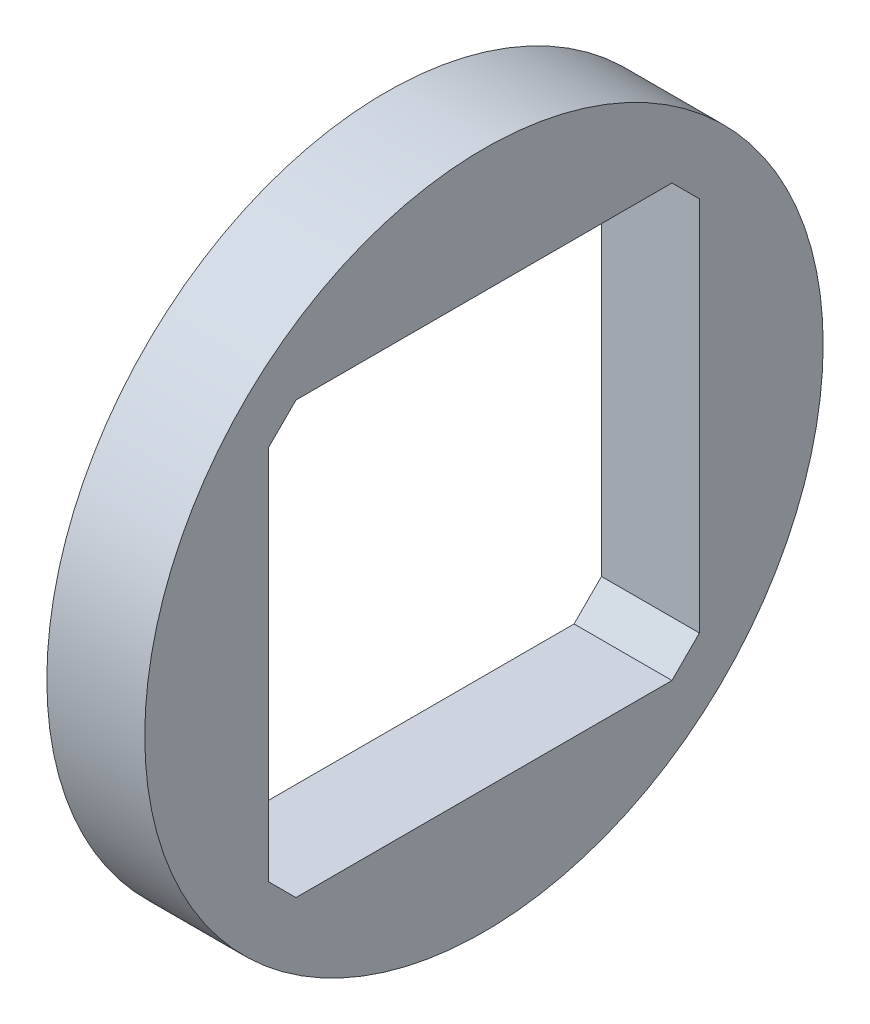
ISO-10303-21;
HEADER;
FILE_DESCRIPTION(('STEP AP214'),'2;1');
FILE_NAME('part.step','',(''),(''),'','','');
FILE_SCHEMA(('AUTOMOTIVE_DESIGN { 1 0 10303 214 1 1 1 1 }'));
ENDSEC;
DATA;
#1=APPLICATION_CONTEXT('core data for automotive mechanical design processes');
#2=APPLICATION_PROTOCOL_DEFINITION('international standard','automotive_design',2000,#1);
#3=PRODUCT_CONTEXT('',#1,'mechanical');
#4=PRODUCT('Part','Part','',(#3));
#5=PRODUCT_RELATED_PRODUCT_CATEGORY('part','',(#4));
#6=PRODUCT_DEFINITION_FORMATION('','',#4);
#7=PRODUCT_DEFINITION_CONTEXT('part definition',#1,'design');
#8=PRODUCT_DEFINITION('design','',#6,#7);
#9=PRODUCT_DEFINITION_SHAPE('','',#8);
#10=(LENGTH_UNIT() NAMED_UNIT(*) SI_UNIT(.MILLI.,.METRE.));
#11=(NAMED_UNIT(*) PLANE_ANGLE_UNIT() SI_UNIT($,.RADIAN.));
#12=(NAMED_UNIT(*) SI_UNIT($,.STERADIAN.) SOLID_ANGLE_UNIT());
#13=UNCERTAINTY_MEASURE_WITH_UNIT(LENGTH_MEASURE(1.E-05),#10,'distance_accuracy_value','');
#14=(GEOMETRIC_REPRESENTATION_CONTEXT(3) GLOBAL_UNCERTAINTY_ASSIGNED_CONTEXT((#13)) GLOBAL_UNIT_ASSIGNED_CONTEXT((#10,
#11,#12)) REPRESENTATION_CONTEXT('',''));
#15=CARTESIAN_POINT('',(0.,0.,0.));
#16=DIRECTION('',(0.,0.,1.));
#17=DIRECTION('',(1.,0.,0.));
#18=AXIS2_PLACEMENT_3D('',#15,#16,#17);
#19=CARTESIAN_POINT('',(6.35,0.,0.));
#20=DIRECTION('',(1.,0.,0.));
#21=DIRECTION('',(0.,0.,-1.));
#22=AXIS2_PLACEMENT_3D('',#19,#20,#21);
#23=PLANE('',#22);
#24=CARTESIAN_POINT('',(6.35,0.,0.));
#25=DIRECTION('',(1.,0.,0.));
#26=DIRECTION('',(0.,0.,-1.));
#27=AXIS2_PLACEMENT_3D('',#24,#25,#26);
#28=CIRCLE('',#27,21.9970452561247);
#29=CARTESIAN_POINT('',(6.35,0.,-21.9970452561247));
#30=VERTEX_POINT('',#29);
#31=EDGE_CURVE('E11',#30,#30,#28,.T.);
#32=ORIENTED_EDGE('',*,*,#31,.T.);
#33=EDGE_LOOP('',(#32));
#34=FACE_BOUND('',#33,.T.);
#35=DIRECTION('',(0.,-0.707106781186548,0.707106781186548));
#36=VECTOR('',#35,1.);
#37=CARTESIAN_POINT('',(6.35,-37.3484604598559,11.1864604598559));
#38=LINE('',#37,#36);
#39=CARTESIAN_POINT('',(6.35,-12.192,-13.97));
#40=VERTEX_POINT('',#39);
#41=CARTESIAN_POINT('',(6.35,-13.97,-12.192));
#42=VERTEX_POINT('',#41);
#43=EDGE_CURVE('E105',#40,#42,#38,.T.);
#44=ORIENTED_EDGE('',*,*,#43,.T.);
#45=DIRECTION('',(0.,0.,-1.));
#46=VECTOR('',#45,1.);
#47=CARTESIAN_POINT('',(6.35,-13.97,0.));
#48=LINE('',#47,#46);
#49=CARTESIAN_POINT('',(6.35,-13.97,12.192));
#50=VERTEX_POINT('',#49);
#51=EDGE_CURVE('E99',#50,#42,#48,.T.);
#52=ORIENTED_EDGE('',*,*,#51,.F.);
#53=DIRECTION('',(0.,0.707106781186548,0.707106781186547));
#54=VECTOR('',#53,1.);
#55=CARTESIAN_POINT('',(6.35,-37.3484604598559,-11.1864604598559));
#56=LINE('',#55,#54);
#57=CARTESIAN_POINT('',(6.35,-12.192,13.97));
#58=VERTEX_POINT('',#57);
#59=EDGE_CURVE('E108',#50,#58,#56,.T.);
#60=ORIENTED_EDGE('',*,*,#59,.T.);
#61=DIRECTION('',(0.,1.,0.));
#62=VECTOR('',#61,1.);
#63=CARTESIAN_POINT('',(6.35,-48.5349209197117,13.97));
#64=LINE('',#63,#62);
#65=CARTESIAN_POINT('',(6.35,12.192,13.97));
#66=VERTEX_POINT('',#65);
#67=EDGE_CURVE('E47',#58,#66,#64,.T.);
#68=ORIENTED_EDGE('',*,*,#67,.T.);
#69=DIRECTION('',(0.,-0.707106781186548,0.707106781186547));
#70=VECTOR('',#69,1.);
#71=CARTESIAN_POINT('',(6.35,-11.1864604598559,37.3484604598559));
#72=LINE('',#71,#70);
#73=CARTESIAN_POINT('',(6.35,13.97,12.192));
#74=VERTEX_POINT('',#73);
#75=EDGE_CURVE('E122',#74,#66,#72,.T.);
#76=ORIENTED_EDGE('',*,*,#75,.F.);
#77=DIRECTION('',(0.,0.,-1.));
#78=VECTOR('',#77,1.);
#79=CARTESIAN_POINT('',(6.35,13.97,0.));
#80=LINE('',#79,#78);
#81=CARTESIAN_POINT('',(6.35,13.97,-12.192));
#82=VERTEX_POINT('',#81);
#83=EDGE_CURVE('E124',#74,#82,#80,.T.);
#84=ORIENTED_EDGE('',*,*,#83,.T.);
#85=DIRECTION('',(0.,0.707106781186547,0.707106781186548));
#86=VECTOR('',#85,1.);
#87=CARTESIAN_POINT('',(6.35,-11.1864604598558,-37.3484604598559));
#88=LINE('',#87,#86);
#89=CARTESIAN_POINT('',(6.35,12.192,-13.97));
#90=VERTEX_POINT('',#89);
#91=EDGE_CURVE('E127',#90,#82,#88,.T.);
#92=ORIENTED_EDGE('',*,*,#91,.F.);
#93=DIRECTION('',(0.,1.,0.));
#94=VECTOR('',#93,1.);
#95=CARTESIAN_POINT('',(6.35,-48.5349209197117,-13.97));
#96=LINE('',#95,#94);
#97=EDGE_CURVE('E129',#40,#90,#96,.T.);
#98=ORIENTED_EDGE('',*,*,#97,.F.);
#99=EDGE_LOOP('',(#44,#52,#60,#68,#76,#84,#92,#98));
#100=FACE_BOUND('',#99,.T.);
#101=ADVANCED_FACE('F32',(#34,#100),#23,.T.);
#102=CARTESIAN_POINT('',(0.,0.,0.));
#103=DIRECTION('',(1.,0.,0.));
#104=DIRECTION('',(0.,0.,-1.));
#105=AXIS2_PLACEMENT_3D('',#102,#103,#104);
#106=PLANE('',#105);
#107=CARTESIAN_POINT('',(0.,0.,0.));
#108=DIRECTION('',(1.,0.,0.));
#109=DIRECTION('',(0.,0.,-1.));
#110=AXIS2_PLACEMENT_3D('',#107,#108,#109);
#111=CIRCLE('',#110,21.9970452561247);
#112=CARTESIAN_POINT('',(0.,0.,-21.9970452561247));
#113=VERTEX_POINT('',#112);
#114=EDGE_CURVE('E36',#113,#113,#111,.T.);
#115=ORIENTED_EDGE('',*,*,#114,.F.);
#116=EDGE_LOOP('',(#115));
#117=FACE_BOUND('',#116,.T.);
#118=DIRECTION('',(0.,0.,-1.));
#119=VECTOR('',#118,1.);
#120=CARTESIAN_POINT('',(0.,-13.97,0.));
#121=LINE('',#120,#119);
#122=CARTESIAN_POINT('',(0.,-13.97,12.192));
#123=VERTEX_POINT('',#122);
#124=CARTESIAN_POINT('',(0.,-13.97,-12.192));
#125=VERTEX_POINT('',#124);
#126=EDGE_CURVE('E55',#123,#125,#121,.T.);
#127=ORIENTED_EDGE('',*,*,#126,.T.);
#128=DIRECTION('',(0.,-0.707106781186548,0.707106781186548));
#129=VECTOR('',#128,1.);
#130=CARTESIAN_POINT('',(0.,-37.3484604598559,11.1864604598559));
#131=LINE('',#130,#129);
#132=CARTESIAN_POINT('',(0.,-12.192,-13.97));
#133=VERTEX_POINT('',#132);
#134=EDGE_CURVE('E115',#133,#125,#131,.T.);
#135=ORIENTED_EDGE('',*,*,#134,.F.);
#136=DIRECTION('',(0.,1.,0.));
#137=VECTOR('',#136,1.);
#138=CARTESIAN_POINT('',(0.,-48.5349209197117,-13.97));
#139=LINE('',#138,#137);
#140=CARTESIAN_POINT('',(0.,12.192,-13.97));
#141=VERTEX_POINT('',#140);
#142=EDGE_CURVE('E118',#133,#141,#139,.T.);
#143=ORIENTED_EDGE('',*,*,#142,.T.);
#144=DIRECTION('',(0.,0.707106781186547,0.707106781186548));
#145=VECTOR('',#144,1.);
#146=CARTESIAN_POINT('',(0.,-11.1864604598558,-37.3484604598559));
#147=LINE('',#146,#145);
#148=CARTESIAN_POINT('',(0.,13.97,-12.192));
#149=VERTEX_POINT('',#148);
#150=EDGE_CURVE('E144',#141,#149,#147,.T.);
#151=ORIENTED_EDGE('',*,*,#150,.T.);
#152=DIRECTION('',(0.,0.,-1.));
#153=VECTOR('',#152,1.);
#154=CARTESIAN_POINT('',(0.,13.97,0.));
#155=LINE('',#154,#153);
#156=CARTESIAN_POINT('',(0.,13.97,12.192));
#157=VERTEX_POINT('',#156);
#158=EDGE_CURVE('E141',#157,#149,#155,.T.);
#159=ORIENTED_EDGE('',*,*,#158,.F.);
#160=DIRECTION('',(0.,-0.707106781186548,0.707106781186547));
#161=VECTOR('',#160,1.);
#162=CARTESIAN_POINT('',(0.,-11.1864604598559,37.3484604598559));
#163=LINE('',#162,#161);
#164=CARTESIAN_POINT('',(0.,12.192,13.97));
#165=VERTEX_POINT('',#164);
#166=EDGE_CURVE('E138',#157,#165,#163,.T.);
#167=ORIENTED_EDGE('',*,*,#166,.T.);
#168=DIRECTION('',(0.,1.,0.));
#169=VECTOR('',#168,1.);
#170=CARTESIAN_POINT('',(0.,-48.5349209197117,13.97));
#171=LINE('',#170,#169);
#172=CARTESIAN_POINT('',(0.,-12.192,13.97));
#173=VERTEX_POINT('',#172);
#174=EDGE_CURVE('E135',#173,#165,#171,.T.);
#175=ORIENTED_EDGE('',*,*,#174,.F.);
#176=DIRECTION('',(0.,0.707106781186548,0.707106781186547));
#177=VECTOR('',#176,1.);
#178=CARTESIAN_POINT('',(0.,-37.3484604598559,-11.1864604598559));
#179=LINE('',#178,#177);
#180=EDGE_CURVE('E133',#123,#173,#179,.T.);
#181=ORIENTED_EDGE('',*,*,#180,.F.);
#182=EDGE_LOOP('',(#127,#135,#143,#151,#159,#167,#175,#181));
#183=FACE_BOUND('',#182,.T.);
#184=ADVANCED_FACE('F164',(#117,#183),#106,.F.);
#185=CARTESIAN_POINT('',(6.35,0.,0.));
#186=DIRECTION('',(-1.,0.,0.));
#187=DIRECTION('',(0.,0.,1.));
#188=AXIS2_PLACEMENT_3D('',#185,#186,#187);
#189=CYLINDRICAL_SURFACE('',#188,21.9970452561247);
#190=ORIENTED_EDGE('',*,*,#31,.F.);
#191=EDGE_LOOP('',(#190));
#192=FACE_BOUND('',#191,.T.);
#193=ORIENTED_EDGE('',*,*,#114,.T.);
#194=EDGE_LOOP('',(#193));
#195=FACE_BOUND('',#194,.T.);
#196=ADVANCED_FACE('F34',(#192,#195),#189,.T.);
#197=CARTESIAN_POINT('',(6.35,-13.97,0.));
#198=DIRECTION('',(0.,1.,0.));
#199=DIRECTION('',(0.,0.,1.));
#200=AXIS2_PLACEMENT_3D('',#197,#198,#199);
#201=PLANE('',#200);
#202=ORIENTED_EDGE('',*,*,#126,.F.);
#203=DIRECTION('',(-1.,0.,0.));
#204=VECTOR('',#203,1.);
#205=CARTESIAN_POINT('',(6.35,-13.97,12.192));
#206=LINE('',#205,#204);
#207=EDGE_CURVE('E95',#50,#123,#206,.T.);
#208=ORIENTED_EDGE('',*,*,#207,.F.);
#209=ORIENTED_EDGE('',*,*,#51,.T.);
#210=DIRECTION('',(-1.,0.,0.));
#211=VECTOR('',#210,1.);
#212=CARTESIAN_POINT('',(6.35,-13.97,-12.192));
#213=LINE('',#212,#211);
#214=EDGE_CURVE('E149',#42,#125,#213,.T.);
#215=ORIENTED_EDGE('',*,*,#214,.T.);
#216=EDGE_LOOP('',(#202,#208,#209,#215));
#217=FACE_BOUND('',#216,.T.);
#218=ADVANCED_FACE('F97',(#217),#201,.T.);
#219=CARTESIAN_POINT('',(6.35,-37.3484604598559,11.1864604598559));
#220=DIRECTION('',(0.,-0.707106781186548,-0.707106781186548));
#221=DIRECTION('',(0.,0.707106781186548,-0.707106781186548));
#222=AXIS2_PLACEMENT_3D('',#219,#220,#221);
#223=PLANE('',#222);
#224=ORIENTED_EDGE('',*,*,#134,.T.);
#225=ORIENTED_EDGE('',*,*,#214,.F.);
#226=ORIENTED_EDGE('',*,*,#43,.F.);
#227=DIRECTION('',(-1.,0.,0.));
#228=VECTOR('',#227,1.);
#229=CARTESIAN_POINT('',(6.35,-12.192,-13.97));
#230=LINE('',#229,#228);
#231=EDGE_CURVE('E151',#40,#133,#230,.T.);
#232=ORIENTED_EDGE('',*,*,#231,.T.);
#233=EDGE_LOOP('',(#224,#225,#226,#232));
#234=FACE_BOUND('',#233,.T.);
#235=ADVANCED_FACE('F184',(#234),#223,.F.);
#236=CARTESIAN_POINT('',(6.35,-48.5349209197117,-13.97));
#237=DIRECTION('',(0.,0.,1.));
#238=DIRECTION('',(0.,-1.,0.));
#239=AXIS2_PLACEMENT_3D('',#236,#237,#238);
#240=PLANE('',#239);
#241=ORIENTED_EDGE('',*,*,#142,.F.);
#242=ORIENTED_EDGE('',*,*,#231,.F.);
#243=ORIENTED_EDGE('',*,*,#97,.T.);
#244=DIRECTION('',(-1.,0.,0.));
#245=VECTOR('',#244,1.);
#246=CARTESIAN_POINT('',(6.35,12.192,-13.97));
#247=LINE('',#246,#245);
#248=EDGE_CURVE('E153',#90,#141,#247,.T.);
#249=ORIENTED_EDGE('',*,*,#248,.T.);
#250=EDGE_LOOP('',(#241,#242,#243,#249));
#251=FACE_BOUND('',#250,.T.);
#252=ADVANCED_FACE('F181',(#251),#240,.T.);
#253=CARTESIAN_POINT('',(6.35,-11.1864604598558,-37.3484604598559));
#254=DIRECTION('',(0.,-0.707106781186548,0.707106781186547));
#255=DIRECTION('',(0.,-0.707106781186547,-0.707106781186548));
#256=AXIS2_PLACEMENT_3D('',#253,#254,#255);
#257=PLANE('',#256);
#258=ORIENTED_EDGE('',*,*,#150,.F.);
#259=ORIENTED_EDGE('',*,*,#248,.F.);
#260=ORIENTED_EDGE('',*,*,#91,.T.);
#261=DIRECTION('',(-1.,0.,0.));
#262=VECTOR('',#261,1.);
#263=CARTESIAN_POINT('',(6.35,13.97,-12.192));
#264=LINE('',#263,#262);
#265=EDGE_CURVE('E155',#82,#149,#264,.T.);
#266=ORIENTED_EDGE('',*,*,#265,.T.);
#267=EDGE_LOOP('',(#258,#259,#260,#266));
#268=FACE_BOUND('',#267,.T.);
#269=ADVANCED_FACE('F177',(#268),#257,.T.);
#270=CARTESIAN_POINT('',(6.35,13.97,0.));
#271=DIRECTION('',(0.,1.,0.));
#272=DIRECTION('',(0.,0.,1.));
#273=AXIS2_PLACEMENT_3D('',#270,#271,#272);
#274=PLANE('',#273);
#275=ORIENTED_EDGE('',*,*,#158,.T.);
#276=ORIENTED_EDGE('',*,*,#265,.F.);
#277=ORIENTED_EDGE('',*,*,#83,.F.);
#278=DIRECTION('',(-1.,0.,0.));
#279=VECTOR('',#278,1.);
#280=CARTESIAN_POINT('',(6.35,13.97,12.192));
#281=LINE('',#280,#279);
#282=EDGE_CURVE('E157',#74,#157,#281,.T.);
#283=ORIENTED_EDGE('',*,*,#282,.T.);
#284=EDGE_LOOP('',(#275,#276,#277,#283));
#285=FACE_BOUND('',#284,.T.);
#286=ADVANCED_FACE('F174',(#285),#274,.F.);
#287=CARTESIAN_POINT('',(6.35,-11.1864604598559,37.3484604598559));
#288=DIRECTION('',(0.,-0.707106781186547,-0.707106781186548));
#289=DIRECTION('',(0.,0.707106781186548,-0.707106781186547));
#290=AXIS2_PLACEMENT_3D('',#287,#288,#289);
#291=PLANE('',#290);
#292=ORIENTED_EDGE('',*,*,#166,.F.);
#293=ORIENTED_EDGE('',*,*,#282,.F.);
#294=ORIENTED_EDGE('',*,*,#75,.T.);
#295=DIRECTION('',(-1.,0.,0.));
#296=VECTOR('',#295,1.);
#297=CARTESIAN_POINT('',(6.35,12.192,13.97));
#298=LINE('',#297,#296);
#299=EDGE_CURVE('E159',#66,#165,#298,.T.);
#300=ORIENTED_EDGE('',*,*,#299,.T.);
#301=EDGE_LOOP('',(#292,#293,#294,#300));
#302=FACE_BOUND('',#301,.T.);
#303=ADVANCED_FACE('F168',(#302),#291,.T.);
#304=CARTESIAN_POINT('',(6.35,-48.5349209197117,13.97));
#305=DIRECTION('',(0.,0.,1.));
#306=DIRECTION('',(1.,0.,0.));
#307=AXIS2_PLACEMENT_3D('',#304,#305,#306);
#308=PLANE('',#307);
#309=ORIENTED_EDGE('',*,*,#174,.T.);
#310=ORIENTED_EDGE('',*,*,#299,.F.);
#311=ORIENTED_EDGE('',*,*,#67,.F.);
#312=DIRECTION('',(-1.,0.,0.));
#313=VECTOR('',#312,1.);
#314=CARTESIAN_POINT('',(6.35,-12.192,13.97));
#315=LINE('',#314,#313);
#316=EDGE_CURVE('E104',#58,#173,#315,.T.);
#317=ORIENTED_EDGE('',*,*,#316,.T.);
#318=EDGE_LOOP('',(#309,#310,#311,#317));
#319=FACE_BOUND('',#318,.T.);
#320=ADVANCED_FACE('F161',(#319),#308,.F.);
#321=CARTESIAN_POINT('',(6.35,-37.3484604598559,-11.1864604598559));
#322=DIRECTION('',(0.,-0.707106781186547,0.707106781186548));
#323=DIRECTION('',(0.,-0.707106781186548,-0.707106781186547));
#324=AXIS2_PLACEMENT_3D('',#321,#322,#323);
#325=PLANE('',#324);
#326=ORIENTED_EDGE('',*,*,#180,.T.);
#327=ORIENTED_EDGE('',*,*,#316,.F.);
#328=ORIENTED_EDGE('',*,*,#59,.F.);
#329=ORIENTED_EDGE('',*,*,#207,.T.);
#330=EDGE_LOOP('',(#326,#327,#328,#329));
#331=FACE_BOUND('',#330,.T.);
#332=ADVANCED_FACE('F109',(#331),#325,.F.);
#333=CLOSED_SHELL('',(#101,#184,#196,#218,#235,#252,#269,#286,#303,#320,#332));
#334=MANIFOLD_SOLID_BREP('B2',#333);
#335=ADVANCED_BREP_SHAPE_REPRESENTATION('',(#18,#334),#14);
#336=SHAPE_DEFINITION_REPRESENTATION(#9,#335);
ENDSEC;
END-ISO-10303-21;
